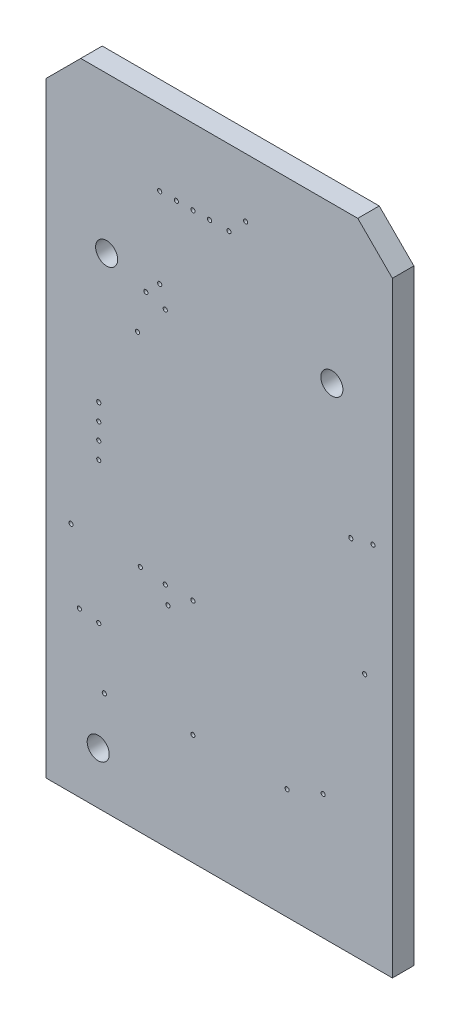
ISO-10303-21;
HEADER;
FILE_DESCRIPTION(('STEP AP214'),'2;1');
FILE_NAME('part.step','',(''),(''),'','','');
FILE_SCHEMA(('AUTOMOTIVE_DESIGN { 1 0 10303 214 1 1 1 1 }'));
ENDSEC;
DATA;
#1=APPLICATION_CONTEXT('core data for automotive mechanical design processes');
#2=APPLICATION_PROTOCOL_DEFINITION('international standard','automotive_design',2000,#1);
#3=PRODUCT_CONTEXT('',#1,'mechanical');
#4=PRODUCT('Part','Part','',(#3));
#5=PRODUCT_RELATED_PRODUCT_CATEGORY('part','',(#4));
#6=PRODUCT_DEFINITION_FORMATION('','',#4);
#7=PRODUCT_DEFINITION_CONTEXT('part definition',#1,'design');
#8=PRODUCT_DEFINITION('design','',#6,#7);
#9=PRODUCT_DEFINITION_SHAPE('','',#8);
#10=(LENGTH_UNIT() NAMED_UNIT(*) SI_UNIT(.MILLI.,.METRE.));
#11=(NAMED_UNIT(*) PLANE_ANGLE_UNIT() SI_UNIT($,.RADIAN.));
#12=(NAMED_UNIT(*) SI_UNIT($,.STERADIAN.) SOLID_ANGLE_UNIT());
#13=UNCERTAINTY_MEASURE_WITH_UNIT(LENGTH_MEASURE(1.E-05),#10,'distance_accuracy_value','');
#14=(GEOMETRIC_REPRESENTATION_CONTEXT(3) GLOBAL_UNCERTAINTY_ASSIGNED_CONTEXT((#13)) GLOBAL_UNIT_ASSIGNED_CONTEXT((#10,
#11,#12)) REPRESENTATION_CONTEXT('',''));
#15=CARTESIAN_POINT('',(0.,0.,0.));
#16=DIRECTION('',(0.,0.,1.));
#17=DIRECTION('',(1.,0.,0.));
#18=AXIS2_PLACEMENT_3D('',#15,#16,#17);
#19=CARTESIAN_POINT('',(12.7,0.,0.7874));
#20=DIRECTION('',(0.,1.,0.));
#21=DIRECTION('',(0.,0.,1.));
#22=AXIS2_PLACEMENT_3D('',#19,#20,#21);
#23=PLANE('',#22);
#24=DIRECTION('',(1.,0.,0.));
#25=VECTOR('',#24,1.);
#26=CARTESIAN_POINT('',(12.7,0.,0.));
#27=LINE('',#26,#25);
#28=CARTESIAN_POINT('',(0.,0.,0.));
#29=VERTEX_POINT('',#28);
#30=CARTESIAN_POINT('',(12.7,0.,0.));
#31=VERTEX_POINT('',#30);
#32=EDGE_CURVE('E125',#29,#31,#27,.T.);
#33=ORIENTED_EDGE('',*,*,#32,.T.);
#34=DIRECTION('',(0.,0.,-1.));
#35=VECTOR('',#34,1.);
#36=CARTESIAN_POINT('',(12.7,0.,0.7874));
#37=LINE('',#36,#35);
#38=CARTESIAN_POINT('',(12.7,0.,0.7874));
#39=VERTEX_POINT('',#38);
#40=EDGE_CURVE('E11',#39,#31,#37,.T.);
#41=ORIENTED_EDGE('',*,*,#40,.F.);
#42=DIRECTION('',(1.,0.,0.));
#43=VECTOR('',#42,1.);
#44=CARTESIAN_POINT('',(12.7,0.,0.7874));
#45=LINE('',#44,#43);
#46=CARTESIAN_POINT('',(0.,0.,0.7874));
#47=VERTEX_POINT('',#46);
#48=EDGE_CURVE('E136',#47,#39,#45,.T.);
#49=ORIENTED_EDGE('',*,*,#48,.F.);
#50=DIRECTION('',(0.,0.,-1.));
#51=VECTOR('',#50,1.);
#52=CARTESIAN_POINT('',(0.,0.,0.7874));
#53=LINE('',#52,#51);
#54=EDGE_CURVE('E121',#47,#29,#53,.T.);
#55=ORIENTED_EDGE('',*,*,#54,.T.);
#56=EDGE_LOOP('',(#33,#41,#49,#55));
#57=FACE_BOUND('',#56,.T.);
#58=ADVANCED_FACE('F41',(#57),#23,.F.);
#59=CARTESIAN_POINT('',(12.7,22.225,0.7874));
#60=DIRECTION('',(-1.,0.,0.));
#61=DIRECTION('',(0.,0.,1.));
#62=AXIS2_PLACEMENT_3D('',#59,#60,#61);
#63=PLANE('',#62);
#64=DIRECTION('',(0.,1.,0.));
#65=VECTOR('',#64,1.);
#66=CARTESIAN_POINT('',(12.7,22.225,0.));
#67=LINE('',#66,#65);
#68=CARTESIAN_POINT('',(12.7,22.225,0.));
#69=VERTEX_POINT('',#68);
#70=EDGE_CURVE('E128',#31,#69,#67,.T.);
#71=ORIENTED_EDGE('',*,*,#70,.T.);
#72=DIRECTION('',(0.,0.,-1.));
#73=VECTOR('',#72,1.);
#74=CARTESIAN_POINT('',(12.7,22.225,0.7874));
#75=LINE('',#74,#73);
#76=CARTESIAN_POINT('',(12.7,22.225,0.7874));
#77=VERTEX_POINT('',#76);
#78=EDGE_CURVE('E49',#77,#69,#75,.T.);
#79=ORIENTED_EDGE('',*,*,#78,.F.);
#80=DIRECTION('',(0.,1.,0.));
#81=VECTOR('',#80,1.);
#82=CARTESIAN_POINT('',(12.7,22.225,0.7874));
#83=LINE('',#82,#81);
#84=EDGE_CURVE('E94',#39,#77,#83,.T.);
#85=ORIENTED_EDGE('',*,*,#84,.F.);
#86=ORIENTED_EDGE('',*,*,#40,.T.);
#87=EDGE_LOOP('',(#71,#79,#85,#86));
#88=FACE_BOUND('',#87,.T.);
#89=ADVANCED_FACE('F161',(#88),#63,.F.);
#90=CARTESIAN_POINT('',(11.43,23.495,0.7874));
#91=DIRECTION('',(-0.707106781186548,-0.707106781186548,0.));
#92=DIRECTION('',(0.707106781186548,-0.707106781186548,0.));
#93=AXIS2_PLACEMENT_3D('',#90,#91,#92);
#94=PLANE('',#93);
#95=DIRECTION('',(-0.707106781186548,0.707106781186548,0.));
#96=VECTOR('',#95,1.);
#97=CARTESIAN_POINT('',(11.43,23.495,0.));
#98=LINE('',#97,#96);
#99=CARTESIAN_POINT('',(11.43,23.495,0.));
#100=VERTEX_POINT('',#99);
#101=EDGE_CURVE('E131',#69,#100,#98,.T.);
#102=ORIENTED_EDGE('',*,*,#101,.T.);
#103=DIRECTION('',(0.,0.,-1.));
#104=VECTOR('',#103,1.);
#105=CARTESIAN_POINT('',(11.43,23.495,0.7874));
#106=LINE('',#105,#104);
#107=CARTESIAN_POINT('',(11.43,23.495,0.7874));
#108=VERTEX_POINT('',#107);
#109=EDGE_CURVE('E116',#108,#100,#106,.T.);
#110=ORIENTED_EDGE('',*,*,#109,.F.);
#111=DIRECTION('',(-0.707106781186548,0.707106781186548,0.));
#112=VECTOR('',#111,1.);
#113=CARTESIAN_POINT('',(11.43,23.495,0.7874));
#114=LINE('',#113,#112);
#115=EDGE_CURVE('E107',#77,#108,#114,.T.);
#116=ORIENTED_EDGE('',*,*,#115,.F.);
#117=ORIENTED_EDGE('',*,*,#78,.T.);
#118=EDGE_LOOP('',(#102,#110,#116,#117));
#119=FACE_BOUND('',#118,.T.);
#120=ADVANCED_FACE('F142',(#119),#94,.F.);
#121=CARTESIAN_POINT('',(1.27,23.495,0.7874));
#122=DIRECTION('',(0.,-1.,0.));
#123=DIRECTION('',(0.,0.,-1.));
#124=AXIS2_PLACEMENT_3D('',#121,#122,#123);
#125=PLANE('',#124);
#126=DIRECTION('',(-1.,0.,0.));
#127=VECTOR('',#126,1.);
#128=CARTESIAN_POINT('',(1.27,23.495,0.));
#129=LINE('',#128,#127);
#130=CARTESIAN_POINT('',(1.27,23.495,0.));
#131=VERTEX_POINT('',#130);
#132=EDGE_CURVE('E115',#100,#131,#129,.T.);
#133=ORIENTED_EDGE('',*,*,#132,.T.);
#134=DIRECTION('',(0.,0.,-1.));
#135=VECTOR('',#134,1.);
#136=CARTESIAN_POINT('',(1.27,23.495,0.7874));
#137=LINE('',#136,#135);
#138=CARTESIAN_POINT('',(1.27,23.495,0.7874));
#139=VERTEX_POINT('',#138);
#140=EDGE_CURVE('E112',#139,#131,#137,.T.);
#141=ORIENTED_EDGE('',*,*,#140,.F.);
#142=DIRECTION('',(-1.,0.,0.));
#143=VECTOR('',#142,1.);
#144=CARTESIAN_POINT('',(1.27,23.495,0.7874));
#145=LINE('',#144,#143);
#146=EDGE_CURVE('E101',#108,#139,#145,.T.);
#147=ORIENTED_EDGE('',*,*,#146,.F.);
#148=ORIENTED_EDGE('',*,*,#109,.T.);
#149=EDGE_LOOP('',(#133,#141,#147,#148));
#150=FACE_BOUND('',#149,.T.);
#151=ADVANCED_FACE('F113',(#150),#125,.F.);
#152=CARTESIAN_POINT('',(0.,22.225,0.7874));
#153=DIRECTION('',(0.707106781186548,-0.707106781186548,0.));
#154=DIRECTION('',(0.707106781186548,0.707106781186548,0.));
#155=AXIS2_PLACEMENT_3D('',#152,#153,#154);
#156=PLANE('',#155);
#157=DIRECTION('',(-0.707106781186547,-0.707106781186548,0.));
#158=VECTOR('',#157,1.);
#159=CARTESIAN_POINT('',(0.,22.225,0.));
#160=LINE('',#159,#158);
#161=CARTESIAN_POINT('',(0.,22.225,0.));
#162=VERTEX_POINT('',#161);
#163=EDGE_CURVE('E80',#131,#162,#160,.T.);
#164=ORIENTED_EDGE('',*,*,#163,.T.);
#165=DIRECTION('',(0.,0.,-1.));
#166=VECTOR('',#165,1.);
#167=CARTESIAN_POINT('',(0.,22.225,0.7874));
#168=LINE('',#167,#166);
#169=CARTESIAN_POINT('',(0.,22.225,0.7874));
#170=VERTEX_POINT('',#169);
#171=EDGE_CURVE('E117',#170,#162,#168,.T.);
#172=ORIENTED_EDGE('',*,*,#171,.F.);
#173=DIRECTION('',(-0.707106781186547,-0.707106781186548,0.));
#174=VECTOR('',#173,1.);
#175=CARTESIAN_POINT('',(0.,22.225,0.7874));
#176=LINE('',#175,#174);
#177=EDGE_CURVE('E105',#139,#170,#176,.T.);
#178=ORIENTED_EDGE('',*,*,#177,.F.);
#179=ORIENTED_EDGE('',*,*,#140,.T.);
#180=EDGE_LOOP('',(#164,#172,#178,#179));
#181=FACE_BOUND('',#180,.T.);
#182=ADVANCED_FACE('F119',(#181),#156,.F.);
#183=CARTESIAN_POINT('',(0.,0.,0.7874));
#184=DIRECTION('',(1.,0.,0.));
#185=DIRECTION('',(0.,0.,-1.));
#186=AXIS2_PLACEMENT_3D('',#183,#184,#185);
#187=PLANE('',#186);
#188=DIRECTION('',(0.,-1.,0.));
#189=VECTOR('',#188,1.);
#190=CARTESIAN_POINT('',(0.,0.,0.));
#191=LINE('',#190,#189);
#192=EDGE_CURVE('E86',#162,#29,#191,.T.);
#193=ORIENTED_EDGE('',*,*,#192,.T.);
#194=ORIENTED_EDGE('',*,*,#54,.F.);
#195=DIRECTION('',(0.,-1.,0.));
#196=VECTOR('',#195,1.);
#197=CARTESIAN_POINT('',(0.,0.,0.7874));
#198=LINE('',#197,#196);
#199=EDGE_CURVE('E57',#170,#47,#198,.T.);
#200=ORIENTED_EDGE('',*,*,#199,.F.);
#201=ORIENTED_EDGE('',*,*,#171,.T.);
#202=EDGE_LOOP('',(#193,#194,#200,#201));
#203=FACE_BOUND('',#202,.T.);
#204=ADVANCED_FACE('F149',(#203),#187,.F.);
#205=CARTESIAN_POINT('',(0.,0.,0.7874));
#206=DIRECTION('',(0.,0.,-1.));
#207=DIRECTION('',(-1.,0.,0.));
#208=AXIS2_PLACEMENT_3D('',#205,#206,#207);
#209=PLANE('',#208);
#210=CARTESIAN_POINT('',(1.91,1.91,0.7874));
#211=DIRECTION('',(0.,0.,1.));
#212=DIRECTION('',(1.,0.,0.));
#213=AXIS2_PLACEMENT_3D('',#210,#211,#212);
#214=CIRCLE('',#213,0.405);
#215=CARTESIAN_POINT('',(2.315,1.91,0.7874));
#216=VERTEX_POINT('',#215);
#217=EDGE_CURVE('E537',#216,#216,#214,.T.);
#218=ORIENTED_EDGE('',*,*,#217,.F.);
#219=EDGE_LOOP('',(#218));
#220=FACE_BOUND('',#219,.T.);
#221=CARTESIAN_POINT('',(10.48,17.78,0.7874));
#222=DIRECTION('',(0.,0.,1.));
#223=DIRECTION('',(1.,0.,0.));
#224=AXIS2_PLACEMENT_3D('',#221,#222,#223);
#225=CIRCLE('',#224,0.405000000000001);
#226=CARTESIAN_POINT('',(10.885,17.78,0.7874));
#227=VERTEX_POINT('',#226);
#228=EDGE_CURVE('E553',#227,#227,#225,.T.);
#229=ORIENTED_EDGE('',*,*,#228,.F.);
#230=EDGE_LOOP('',(#229));
#231=FACE_BOUND('',#230,.T.);
#232=CARTESIAN_POINT('',(2.22,17.78,0.7874));
#233=DIRECTION('',(0.,0.,1.));
#234=DIRECTION('',(1.,0.,0.));
#235=AXIS2_PLACEMENT_3D('',#232,#233,#234);
#236=CIRCLE('',#235,0.405);
#237=CARTESIAN_POINT('',(2.625,17.78,0.7874));
#238=VERTEX_POINT('',#237);
#239=EDGE_CURVE('E546',#238,#238,#236,.T.);
#240=ORIENTED_EDGE('',*,*,#239,.F.);
#241=EDGE_LOOP('',(#240));
#242=FACE_BOUND('',#241,.T.);
#243=CARTESIAN_POINT('',(2.1336,3.7592,0.7874));
#244=DIRECTION('',(0.,0.,1.));
#245=DIRECTION('',(1.,0.,0.));
#246=AXIS2_PLACEMENT_3D('',#243,#244,#245);
#247=CIRCLE('',#246,0.0761999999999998);
#248=CARTESIAN_POINT('',(2.2098,3.7592,0.7874));
#249=VERTEX_POINT('',#248);
#250=EDGE_CURVE('E644',#249,#249,#247,.T.);
#251=ORIENTED_EDGE('',*,*,#250,.F.);
#252=EDGE_LOOP('',(#251));
#253=FACE_BOUND('',#252,.T.);
#254=CARTESIAN_POINT('',(4.4704,7.7216,0.7874));
#255=DIRECTION('',(0.,0.,1.));
#256=DIRECTION('',(1.,0.,0.));
#257=AXIS2_PLACEMENT_3D('',#254,#255,#256);
#258=CIRCLE('',#257,0.0762000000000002);
#259=CARTESIAN_POINT('',(4.5466,7.7216,0.7874));
#260=VERTEX_POINT('',#259);
#261=EDGE_CURVE('E651',#260,#260,#258,.T.);
#262=ORIENTED_EDGE('',*,*,#261,.F.);
#263=EDGE_LOOP('',(#262));
#264=FACE_BOUND('',#263,.T.);
#265=CARTESIAN_POINT('',(8.8392,4.064,0.7874));
#266=DIRECTION('',(0.,0.,1.));
#267=DIRECTION('',(1.,0.,0.));
#268=AXIS2_PLACEMENT_3D('',#265,#266,#267);
#269=CIRCLE('',#268,0.0762000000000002);
#270=CARTESIAN_POINT('',(8.9154,4.064,0.7874));
#271=VERTEX_POINT('',#270);
#272=EDGE_CURVE('E657',#271,#271,#269,.T.);
#273=ORIENTED_EDGE('',*,*,#272,.F.);
#274=EDGE_LOOP('',(#273));
#275=FACE_BOUND('',#274,.T.);
#276=CARTESIAN_POINT('',(5.3848,20.7264,0.7874));
#277=DIRECTION('',(0.,0.,1.));
#278=DIRECTION('',(1.,0.,0.));
#279=AXIS2_PLACEMENT_3D('',#276,#277,#278);
#280=CIRCLE('',#279,0.0762000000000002);
#281=CARTESIAN_POINT('',(5.461,20.7264,0.7874));
#282=VERTEX_POINT('',#281);
#283=EDGE_CURVE('E663',#282,#282,#280,.T.);
#284=ORIENTED_EDGE('',*,*,#283,.F.);
#285=EDGE_LOOP('',(#284));
#286=FACE_BOUND('',#285,.T.);
#287=CARTESIAN_POINT('',(4.1656,20.7264,0.7874));
#288=DIRECTION('',(0.,0.,1.));
#289=DIRECTION('',(1.,0.,0.));
#290=AXIS2_PLACEMENT_3D('',#287,#288,#289);
#291=CIRCLE('',#290,0.0762000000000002);
#292=CARTESIAN_POINT('',(4.2418,20.7264,0.7874));
#293=VERTEX_POINT('',#292);
#294=EDGE_CURVE('E627',#293,#293,#291,.T.);
#295=ORIENTED_EDGE('',*,*,#294,.F.);
#296=EDGE_LOOP('',(#295));
#297=FACE_BOUND('',#296,.T.);
#298=CARTESIAN_POINT('',(4.3688,17.0688,0.7874));
#299=DIRECTION('',(0.,0.,1.));
#300=DIRECTION('',(1.,0.,0.));
#301=AXIS2_PLACEMENT_3D('',#298,#299,#300);
#302=CIRCLE('',#301,0.0762000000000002);
#303=CARTESIAN_POINT('',(4.445,17.0688,0.7874));
#304=VERTEX_POINT('',#303);
#305=EDGE_CURVE('E620',#304,#304,#302,.T.);
#306=ORIENTED_EDGE('',*,*,#305,.F.);
#307=EDGE_LOOP('',(#306));
#308=FACE_BOUND('',#307,.T.);
#309=CARTESIAN_POINT('',(4.7752,20.7264,0.7874));
#310=DIRECTION('',(0.,0.,1.));
#311=DIRECTION('',(1.,0.,0.));
#312=AXIS2_PLACEMENT_3D('',#309,#310,#311);
#313=CIRCLE('',#312,0.0762000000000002);
#314=CARTESIAN_POINT('',(4.8514,20.7264,0.7874));
#315=VERTEX_POINT('',#314);
#316=EDGE_CURVE('E639',#315,#315,#313,.T.);
#317=ORIENTED_EDGE('',*,*,#316,.F.);
#318=EDGE_LOOP('',(#317));
#319=FACE_BOUND('',#318,.T.);
#320=CARTESIAN_POINT('',(3.3528,15.8496,0.7874));
#321=DIRECTION('',(0.,0.,1.));
#322=DIRECTION('',(1.,0.,0.));
#323=AXIS2_PLACEMENT_3D('',#320,#321,#322);
#324=CIRCLE('',#323,0.0761999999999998);
#325=CARTESIAN_POINT('',(3.429,15.8496,0.7874));
#326=VERTEX_POINT('',#325);
#327=EDGE_CURVE('E632',#326,#326,#324,.T.);
#328=ORIENTED_EDGE('',*,*,#327,.F.);
#329=EDGE_LOOP('',(#328));
#330=FACE_BOUND('',#329,.T.);
#331=CARTESIAN_POINT('',(10.16,4.572,0.7874));
#332=DIRECTION('',(0.,0.,1.));
#333=DIRECTION('',(1.,0.,0.));
#334=AXIS2_PLACEMENT_3D('',#331,#332,#333);
#335=CIRCLE('',#334,0.0762000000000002);
#336=CARTESIAN_POINT('',(10.2362,4.572,0.7874));
#337=VERTEX_POINT('',#336);
#338=EDGE_CURVE('E692',#337,#337,#335,.T.);
#339=ORIENTED_EDGE('',*,*,#338,.F.);
#340=EDGE_LOOP('',(#339));
#341=FACE_BOUND('',#340,.T.);
#342=CARTESIAN_POINT('',(11.684,9.144,0.7874));
#343=DIRECTION('',(0.,0.,1.));
#344=DIRECTION('',(1.,0.,0.));
#345=AXIS2_PLACEMENT_3D('',#342,#343,#344);
#346=CIRCLE('',#345,0.0762000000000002);
#347=CARTESIAN_POINT('',(11.7602,9.144,0.7874));
#348=VERTEX_POINT('',#347);
#349=EDGE_CURVE('E699',#348,#348,#346,.T.);
#350=ORIENTED_EDGE('',*,*,#349,.F.);
#351=EDGE_LOOP('',(#350));
#352=FACE_BOUND('',#351,.T.);
#353=CARTESIAN_POINT('',(4.3688,8.3312,0.7874));
#354=DIRECTION('',(0.,0.,1.));
#355=DIRECTION('',(1.,0.,0.));
#356=AXIS2_PLACEMENT_3D('',#353,#354,#355);
#357=CIRCLE('',#356,0.0762000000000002);
#358=CARTESIAN_POINT('',(4.445,8.3312,0.7874));
#359=VERTEX_POINT('',#358);
#360=EDGE_CURVE('E705',#359,#359,#357,.T.);
#361=ORIENTED_EDGE('',*,*,#360,.F.);
#362=EDGE_LOOP('',(#361));
#363=FACE_BOUND('',#362,.T.);
#364=CARTESIAN_POINT('',(1.9304,11.684,0.7874));
#365=DIRECTION('',(0.,0.,1.));
#366=DIRECTION('',(1.,0.,0.));
#367=AXIS2_PLACEMENT_3D('',#364,#365,#366);
#368=CIRCLE('',#367,0.0762);
#369=CARTESIAN_POINT('',(2.0066,11.684,0.7874));
#370=VERTEX_POINT('',#369);
#371=EDGE_CURVE('E711',#370,#370,#368,.T.);
#372=ORIENTED_EDGE('',*,*,#371,.F.);
#373=EDGE_LOOP('',(#372));
#374=FACE_BOUND('',#373,.T.);
#375=CARTESIAN_POINT('',(7.3152,21.336,0.7874));
#376=DIRECTION('',(0.,0.,1.));
#377=DIRECTION('',(1.,0.,0.));
#378=AXIS2_PLACEMENT_3D('',#375,#376,#377);
#379=CIRCLE('',#378,0.0762000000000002);
#380=CARTESIAN_POINT('',(7.3914,21.336,0.7874));
#381=VERTEX_POINT('',#380);
#382=EDGE_CURVE('E668',#381,#381,#379,.T.);
#383=ORIENTED_EDGE('',*,*,#382,.F.);
#384=EDGE_LOOP('',(#383));
#385=FACE_BOUND('',#384,.T.);
#386=CARTESIAN_POINT('',(6.7056,20.7264,0.7874));
#387=DIRECTION('',(0.,0.,1.));
#388=DIRECTION('',(1.,0.,0.));
#389=AXIS2_PLACEMENT_3D('',#386,#387,#388);
#390=CIRCLE('',#389,0.0762000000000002);
#391=CARTESIAN_POINT('',(6.7818,20.7264,0.7874));
#392=VERTEX_POINT('',#391);
#393=EDGE_CURVE('E675',#392,#392,#390,.T.);
#394=ORIENTED_EDGE('',*,*,#393,.F.);
#395=EDGE_LOOP('',(#394));
#396=FACE_BOUND('',#395,.T.);
#397=CARTESIAN_POINT('',(11.176,13.208,0.7874));
#398=DIRECTION('',(0.,0.,1.));
#399=DIRECTION('',(1.,0.,0.));
#400=AXIS2_PLACEMENT_3D('',#397,#398,#399);
#401=CIRCLE('',#400,0.0762000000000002);
#402=CARTESIAN_POINT('',(11.2522,13.208,0.7874));
#403=VERTEX_POINT('',#402);
#404=EDGE_CURVE('E681',#403,#403,#401,.T.);
#405=ORIENTED_EDGE('',*,*,#404,.F.);
#406=EDGE_LOOP('',(#405));
#407=FACE_BOUND('',#406,.T.);
#408=CARTESIAN_POINT('',(3.4544,8.4328,0.7874));
#409=DIRECTION('',(0.,0.,1.));
#410=DIRECTION('',(1.,0.,0.));
#411=AXIS2_PLACEMENT_3D('',#408,#409,#410);
#412=CIRCLE('',#411,0.0761999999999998);
#413=CARTESIAN_POINT('',(3.5306,8.4328,0.7874));
#414=VERTEX_POINT('',#413);
#415=EDGE_CURVE('E687',#414,#414,#412,.T.);
#416=ORIENTED_EDGE('',*,*,#415,.F.);
#417=EDGE_LOOP('',(#416));
#418=FACE_BOUND('',#417,.T.);
#419=CARTESIAN_POINT('',(11.9888,13.4112,0.7874));
#420=DIRECTION('',(0.,0.,1.));
#421=DIRECTION('',(1.,0.,0.));
#422=AXIS2_PLACEMENT_3D('',#419,#420,#421);
#423=CIRCLE('',#422,0.0762000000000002);
#424=CARTESIAN_POINT('',(12.065,13.4112,0.7874));
#425=VERTEX_POINT('',#424);
#426=EDGE_CURVE('E567',#425,#425,#423,.T.);
#427=ORIENTED_EDGE('',*,*,#426,.F.);
#428=EDGE_LOOP('',(#427));
#429=FACE_BOUND('',#428,.T.);
#430=CARTESIAN_POINT('',(1.9304,11.0744,0.7874));
#431=DIRECTION('',(0.,0.,1.));
#432=DIRECTION('',(1.,0.,0.));
#433=AXIS2_PLACEMENT_3D('',#430,#431,#432);
#434=CIRCLE('',#433,0.0762);
#435=CARTESIAN_POINT('',(2.0066,11.0744,0.7874));
#436=VERTEX_POINT('',#435);
#437=EDGE_CURVE('E561',#436,#436,#434,.T.);
#438=ORIENTED_EDGE('',*,*,#437,.F.);
#439=EDGE_LOOP('',(#438));
#440=FACE_BOUND('',#439,.T.);
#441=CARTESIAN_POINT('',(1.9304,12.9032,0.7874));
#442=DIRECTION('',(0.,0.,1.));
#443=DIRECTION('',(1.,0.,0.));
#444=AXIS2_PLACEMENT_3D('',#441,#442,#443);
#445=CIRCLE('',#444,0.0762);
#446=CARTESIAN_POINT('',(2.0066,12.9032,0.7874));
#447=VERTEX_POINT('',#446);
#448=EDGE_CURVE('E554',#447,#447,#445,.T.);
#449=ORIENTED_EDGE('',*,*,#448,.F.);
#450=EDGE_LOOP('',(#449));
#451=FACE_BOUND('',#450,.T.);
#452=CARTESIAN_POINT('',(4.1656,17.78,0.7874));
#453=DIRECTION('',(0.,0.,1.));
#454=DIRECTION('',(1.,0.,0.));
#455=AXIS2_PLACEMENT_3D('',#452,#453,#454);
#456=CIRCLE('',#455,0.0762000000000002);
#457=CARTESIAN_POINT('',(4.2418,17.78,0.7874));
#458=VERTEX_POINT('',#457);
#459=EDGE_CURVE('E596',#458,#458,#456,.T.);
#460=ORIENTED_EDGE('',*,*,#459,.F.);
#461=EDGE_LOOP('',(#460));
#462=FACE_BOUND('',#461,.T.);
#463=CARTESIAN_POINT('',(5.9944,20.7264,0.7874));
#464=DIRECTION('',(0.,0.,1.));
#465=DIRECTION('',(1.,0.,0.));
#466=AXIS2_PLACEMENT_3D('',#463,#464,#465);
#467=CIRCLE('',#466,0.0762000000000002);
#468=CARTESIAN_POINT('',(6.0706,20.7264,0.7874));
#469=VERTEX_POINT('',#468);
#470=EDGE_CURVE('E603',#469,#469,#467,.T.);
#471=ORIENTED_EDGE('',*,*,#470,.F.);
#472=EDGE_LOOP('',(#471));
#473=FACE_BOUND('',#472,.T.);
#474=CARTESIAN_POINT('',(3.6576,17.272,0.7874));
#475=DIRECTION('',(0.,0.,1.));
#476=DIRECTION('',(1.,0.,0.));
#477=AXIS2_PLACEMENT_3D('',#474,#475,#476);
#478=CIRCLE('',#477,0.0761999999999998);
#479=CARTESIAN_POINT('',(3.7338,17.272,0.7874));
#480=VERTEX_POINT('',#479);
#481=EDGE_CURVE('E609',#480,#480,#478,.T.);
#482=ORIENTED_EDGE('',*,*,#481,.F.);
#483=EDGE_LOOP('',(#482));
#484=FACE_BOUND('',#483,.T.);
#485=CARTESIAN_POINT('',(5.3848,8.3312,0.7874));
#486=DIRECTION('',(0.,0.,1.));
#487=DIRECTION('',(1.,0.,0.));
#488=AXIS2_PLACEMENT_3D('',#485,#486,#487);
#489=CIRCLE('',#488,0.0762000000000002);
#490=CARTESIAN_POINT('',(5.461,8.3312,0.7874));
#491=VERTEX_POINT('',#490);
#492=EDGE_CURVE('E615',#491,#491,#489,.T.);
#493=ORIENTED_EDGE('',*,*,#492,.F.);
#494=EDGE_LOOP('',(#493));
#495=FACE_BOUND('',#494,.T.);
#496=CARTESIAN_POINT('',(0.9144,8.5344,0.7874));
#497=DIRECTION('',(0.,0.,1.));
#498=DIRECTION('',(1.,0.,0.));
#499=AXIS2_PLACEMENT_3D('',#496,#497,#498);
#500=CIRCLE('',#499,0.0761999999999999);
#501=CARTESIAN_POINT('',(0.9906,8.5344,0.7874));
#502=VERTEX_POINT('',#501);
#503=EDGE_CURVE('E579',#502,#502,#500,.T.);
#504=ORIENTED_EDGE('',*,*,#503,.F.);
#505=EDGE_LOOP('',(#504));
#506=FACE_BOUND('',#505,.T.);
#507=CARTESIAN_POINT('',(1.9304,5.8928,0.7874));
#508=DIRECTION('',(0.,0.,1.));
#509=DIRECTION('',(1.,0.,0.));
#510=AXIS2_PLACEMENT_3D('',#507,#508,#509);
#511=CIRCLE('',#510,0.0762);
#512=CARTESIAN_POINT('',(2.0066,5.8928,0.7874));
#513=VERTEX_POINT('',#512);
#514=EDGE_CURVE('E572',#513,#513,#511,.T.);
#515=ORIENTED_EDGE('',*,*,#514,.F.);
#516=EDGE_LOOP('',(#515));
#517=FACE_BOUND('',#516,.T.);
#518=CARTESIAN_POINT('',(1.9304,12.2936,0.7874));
#519=DIRECTION('',(0.,0.,1.));
#520=DIRECTION('',(1.,0.,0.));
#521=AXIS2_PLACEMENT_3D('',#518,#519,#520);
#522=CIRCLE('',#521,0.0762);
#523=CARTESIAN_POINT('',(2.0066,12.2936,0.7874));
#524=VERTEX_POINT('',#523);
#525=EDGE_CURVE('E591',#524,#524,#522,.T.);
#526=ORIENTED_EDGE('',*,*,#525,.F.);
#527=EDGE_LOOP('',(#526));
#528=FACE_BOUND('',#527,.T.);
#529=CARTESIAN_POINT('',(5.3848,4.064,0.7874));
#530=DIRECTION('',(0.,0.,1.));
#531=DIRECTION('',(1.,0.,0.));
#532=AXIS2_PLACEMENT_3D('',#529,#530,#531);
#533=CIRCLE('',#532,0.0762000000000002);
#534=CARTESIAN_POINT('',(5.461,4.064,0.7874));
#535=VERTEX_POINT('',#534);
#536=EDGE_CURVE('E584',#535,#535,#533,.T.);
#537=ORIENTED_EDGE('',*,*,#536,.F.);
#538=EDGE_LOOP('',(#537));
#539=FACE_BOUND('',#538,.T.);
#540=CARTESIAN_POINT('',(1.2192,5.9944,0.7874));
#541=DIRECTION('',(0.,0.,1.));
#542=DIRECTION('',(1.,0.,0.));
#543=AXIS2_PLACEMENT_3D('',#540,#541,#542);
#544=CIRCLE('',#543,0.0762);
#545=CARTESIAN_POINT('',(1.2954,5.9944,0.7874));
#546=VERTEX_POINT('',#545);
#547=EDGE_CURVE('E129',#546,#546,#544,.T.);
#548=ORIENTED_EDGE('',*,*,#547,.F.);
#549=EDGE_LOOP('',(#548));
#550=FACE_BOUND('',#549,.T.);
#551=ORIENTED_EDGE('',*,*,#48,.T.);
#552=ORIENTED_EDGE('',*,*,#84,.T.);
#553=ORIENTED_EDGE('',*,*,#115,.T.);
#554=ORIENTED_EDGE('',*,*,#146,.T.);
#555=ORIENTED_EDGE('',*,*,#177,.T.);
#556=ORIENTED_EDGE('',*,*,#199,.T.);
#557=EDGE_LOOP('',(#551,#552,#553,#554,#555,#556));
#558=FACE_BOUND('',#557,.T.);
#559=ADVANCED_FACE('F103',(#220,#231,#242,#253,#264,#275,#286,#297,#308,#319,#330,#341,#352,
#363,#374,#385,#396,#407,#418,#429,#440,#451,#462,#473,#484,#495,#506,#517,#528,#539,#550,#558),
#209,.F.);
#560=CARTESIAN_POINT('',(0.,0.,0.));
#561=DIRECTION('',(0.,0.,-1.));
#562=DIRECTION('',(-1.,0.,0.));
#563=AXIS2_PLACEMENT_3D('',#560,#561,#562);
#564=PLANE('',#563);
#565=CARTESIAN_POINT('',(1.91,1.91,0.));
#566=DIRECTION('',(0.,0.,1.));
#567=DIRECTION('',(1.,0.,0.));
#568=AXIS2_PLACEMENT_3D('',#565,#566,#567);
#569=CIRCLE('',#568,0.405);
#570=CARTESIAN_POINT('',(2.315,1.91,0.));
#571=VERTEX_POINT('',#570);
#572=EDGE_CURVE('E540',#571,#571,#569,.T.);
#573=ORIENTED_EDGE('',*,*,#572,.T.);
#574=EDGE_LOOP('',(#573));
#575=FACE_BOUND('',#574,.T.);
#576=CARTESIAN_POINT('',(10.48,17.78,0.));
#577=DIRECTION('',(0.,0.,1.));
#578=DIRECTION('',(1.,0.,0.));
#579=AXIS2_PLACEMENT_3D('',#576,#577,#578);
#580=CIRCLE('',#579,0.405000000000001);
#581=CARTESIAN_POINT('',(10.885,17.78,0.));
#582=VERTEX_POINT('',#581);
#583=EDGE_CURVE('E542',#582,#582,#580,.T.);
#584=ORIENTED_EDGE('',*,*,#583,.T.);
#585=EDGE_LOOP('',(#584));
#586=FACE_BOUND('',#585,.T.);
#587=CARTESIAN_POINT('',(2.22,17.78,0.));
#588=DIRECTION('',(0.,0.,1.));
#589=DIRECTION('',(1.,0.,0.));
#590=AXIS2_PLACEMENT_3D('',#587,#588,#589);
#591=CIRCLE('',#590,0.405);
#592=CARTESIAN_POINT('',(2.625,17.78,0.));
#593=VERTEX_POINT('',#592);
#594=EDGE_CURVE('E550',#593,#593,#591,.T.);
#595=ORIENTED_EDGE('',*,*,#594,.T.);
#596=EDGE_LOOP('',(#595));
#597=FACE_BOUND('',#596,.T.);
#598=CARTESIAN_POINT('',(2.1336,3.7592,0.));
#599=DIRECTION('',(0.,0.,1.));
#600=DIRECTION('',(1.,0.,0.));
#601=AXIS2_PLACEMENT_3D('',#598,#599,#600);
#602=CIRCLE('',#601,0.0761999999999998);
#603=CARTESIAN_POINT('',(2.2098,3.7592,0.));
#604=VERTEX_POINT('',#603);
#605=EDGE_CURVE('E648',#604,#604,#602,.T.);
#606=ORIENTED_EDGE('',*,*,#605,.T.);
#607=EDGE_LOOP('',(#606));
#608=FACE_BOUND('',#607,.T.);
#609=CARTESIAN_POINT('',(4.4704,7.7216,0.));
#610=DIRECTION('',(0.,0.,1.));
#611=DIRECTION('',(1.,0.,0.));
#612=AXIS2_PLACEMENT_3D('',#609,#610,#611);
#613=CIRCLE('',#612,0.0762000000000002);
#614=CARTESIAN_POINT('',(4.5466,7.7216,0.));
#615=VERTEX_POINT('',#614);
#616=EDGE_CURVE('E654',#615,#615,#613,.T.);
#617=ORIENTED_EDGE('',*,*,#616,.T.);
#618=EDGE_LOOP('',(#617));
#619=FACE_BOUND('',#618,.T.);
#620=CARTESIAN_POINT('',(8.8392,4.064,0.));
#621=DIRECTION('',(0.,0.,1.));
#622=DIRECTION('',(1.,0.,0.));
#623=AXIS2_PLACEMENT_3D('',#620,#621,#622);
#624=CIRCLE('',#623,0.0762000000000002);
#625=CARTESIAN_POINT('',(8.9154,4.064,0.));
#626=VERTEX_POINT('',#625);
#627=EDGE_CURVE('E660',#626,#626,#624,.T.);
#628=ORIENTED_EDGE('',*,*,#627,.T.);
#629=EDGE_LOOP('',(#628));
#630=FACE_BOUND('',#629,.T.);
#631=CARTESIAN_POINT('',(5.3848,20.7264,0.));
#632=DIRECTION('',(0.,0.,1.));
#633=DIRECTION('',(1.,0.,0.));
#634=AXIS2_PLACEMENT_3D('',#631,#632,#633);
#635=CIRCLE('',#634,0.0762000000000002);
#636=CARTESIAN_POINT('',(5.461,20.7264,0.));
#637=VERTEX_POINT('',#636);
#638=EDGE_CURVE('E635',#637,#637,#635,.T.);
#639=ORIENTED_EDGE('',*,*,#638,.T.);
#640=EDGE_LOOP('',(#639));
#641=FACE_BOUND('',#640,.T.);
#642=CARTESIAN_POINT('',(4.1656,20.7264,0.));
#643=DIRECTION('',(0.,0.,1.));
#644=DIRECTION('',(1.,0.,0.));
#645=AXIS2_PLACEMENT_3D('',#642,#643,#644);
#646=CIRCLE('',#645,0.0762000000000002);
#647=CARTESIAN_POINT('',(4.2418,20.7264,0.));
#648=VERTEX_POINT('',#647);
#649=EDGE_CURVE('E599',#648,#648,#646,.T.);
#650=ORIENTED_EDGE('',*,*,#649,.T.);
#651=EDGE_LOOP('',(#650));
#652=FACE_BOUND('',#651,.T.);
#653=CARTESIAN_POINT('',(4.3688,17.0688,0.));
#654=DIRECTION('',(0.,0.,1.));
#655=DIRECTION('',(1.,0.,0.));
#656=AXIS2_PLACEMENT_3D('',#653,#654,#655);
#657=CIRCLE('',#656,0.0762000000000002);
#658=CARTESIAN_POINT('',(4.445,17.0688,0.));
#659=VERTEX_POINT('',#658);
#660=EDGE_CURVE('E624',#659,#659,#657,.T.);
#661=ORIENTED_EDGE('',*,*,#660,.T.);
#662=EDGE_LOOP('',(#661));
#663=FACE_BOUND('',#662,.T.);
#664=CARTESIAN_POINT('',(4.7752,20.7264,0.));
#665=DIRECTION('',(0.,0.,1.));
#666=DIRECTION('',(1.,0.,0.));
#667=AXIS2_PLACEMENT_3D('',#664,#665,#666);
#668=CIRCLE('',#667,0.0762000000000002);
#669=CARTESIAN_POINT('',(4.8514,20.7264,0.));
#670=VERTEX_POINT('',#669);
#671=EDGE_CURVE('E623',#670,#670,#668,.T.);
#672=ORIENTED_EDGE('',*,*,#671,.T.);
#673=EDGE_LOOP('',(#672));
#674=FACE_BOUND('',#673,.T.);
#675=CARTESIAN_POINT('',(3.3528,15.8496,0.));
#676=DIRECTION('',(0.,0.,1.));
#677=DIRECTION('',(1.,0.,0.));
#678=AXIS2_PLACEMENT_3D('',#675,#676,#677);
#679=CIRCLE('',#678,0.0761999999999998);
#680=CARTESIAN_POINT('',(3.429,15.8496,0.));
#681=VERTEX_POINT('',#680);
#682=EDGE_CURVE('E636',#681,#681,#679,.T.);
#683=ORIENTED_EDGE('',*,*,#682,.T.);
#684=EDGE_LOOP('',(#683));
#685=FACE_BOUND('',#684,.T.);
#686=CARTESIAN_POINT('',(10.16,4.572,0.));
#687=DIRECTION('',(0.,0.,1.));
#688=DIRECTION('',(1.,0.,0.));
#689=AXIS2_PLACEMENT_3D('',#686,#687,#688);
#690=CIRCLE('',#689,0.0762000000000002);
#691=CARTESIAN_POINT('',(10.2362,4.572,0.));
#692=VERTEX_POINT('',#691);
#693=EDGE_CURVE('E696',#692,#692,#690,.T.);
#694=ORIENTED_EDGE('',*,*,#693,.T.);
#695=EDGE_LOOP('',(#694));
#696=FACE_BOUND('',#695,.T.);
#697=CARTESIAN_POINT('',(11.684,9.144,0.));
#698=DIRECTION('',(0.,0.,1.));
#699=DIRECTION('',(1.,0.,0.));
#700=AXIS2_PLACEMENT_3D('',#697,#698,#699);
#701=CIRCLE('',#700,0.0762000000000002);
#702=CARTESIAN_POINT('',(11.7602,9.144,0.));
#703=VERTEX_POINT('',#702);
#704=EDGE_CURVE('E702',#703,#703,#701,.T.);
#705=ORIENTED_EDGE('',*,*,#704,.T.);
#706=EDGE_LOOP('',(#705));
#707=FACE_BOUND('',#706,.T.);
#708=CARTESIAN_POINT('',(4.3688,8.3312,0.));
#709=DIRECTION('',(0.,0.,1.));
#710=DIRECTION('',(1.,0.,0.));
#711=AXIS2_PLACEMENT_3D('',#708,#709,#710);
#712=CIRCLE('',#711,0.0762000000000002);
#713=CARTESIAN_POINT('',(4.445,8.3312,0.));
#714=VERTEX_POINT('',#713);
#715=EDGE_CURVE('E708',#714,#714,#712,.T.);
#716=ORIENTED_EDGE('',*,*,#715,.T.);
#717=EDGE_LOOP('',(#716));
#718=FACE_BOUND('',#717,.T.);
#719=CARTESIAN_POINT('',(1.9304,11.684,0.));
#720=DIRECTION('',(0.,0.,1.));
#721=DIRECTION('',(1.,0.,0.));
#722=AXIS2_PLACEMENT_3D('',#719,#720,#721);
#723=CIRCLE('',#722,0.0762);
#724=CARTESIAN_POINT('',(2.0066,11.684,0.));
#725=VERTEX_POINT('',#724);
#726=EDGE_CURVE('E671',#725,#725,#723,.T.);
#727=ORIENTED_EDGE('',*,*,#726,.T.);
#728=EDGE_LOOP('',(#727));
#729=FACE_BOUND('',#728,.T.);
#730=CARTESIAN_POINT('',(7.3152,21.336,0.));
#731=DIRECTION('',(0.,0.,1.));
#732=DIRECTION('',(1.,0.,0.));
#733=AXIS2_PLACEMENT_3D('',#730,#731,#732);
#734=CIRCLE('',#733,0.0762000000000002);
#735=CARTESIAN_POINT('',(7.3914,21.336,0.));
#736=VERTEX_POINT('',#735);
#737=EDGE_CURVE('E672',#736,#736,#734,.T.);
#738=ORIENTED_EDGE('',*,*,#737,.T.);
#739=EDGE_LOOP('',(#738));
#740=FACE_BOUND('',#739,.T.);
#741=CARTESIAN_POINT('',(6.7056,20.7264,0.));
#742=DIRECTION('',(0.,0.,1.));
#743=DIRECTION('',(1.,0.,0.));
#744=AXIS2_PLACEMENT_3D('',#741,#742,#743);
#745=CIRCLE('',#744,0.0762000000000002);
#746=CARTESIAN_POINT('',(6.7818,20.7264,0.));
#747=VERTEX_POINT('',#746);
#748=EDGE_CURVE('E678',#747,#747,#745,.T.);
#749=ORIENTED_EDGE('',*,*,#748,.T.);
#750=EDGE_LOOP('',(#749));
#751=FACE_BOUND('',#750,.T.);
#752=CARTESIAN_POINT('',(11.176,13.208,0.));
#753=DIRECTION('',(0.,0.,1.));
#754=DIRECTION('',(1.,0.,0.));
#755=AXIS2_PLACEMENT_3D('',#752,#753,#754);
#756=CIRCLE('',#755,0.0762000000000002);
#757=CARTESIAN_POINT('',(11.2522,13.208,0.));
#758=VERTEX_POINT('',#757);
#759=EDGE_CURVE('E684',#758,#758,#756,.T.);
#760=ORIENTED_EDGE('',*,*,#759,.T.);
#761=EDGE_LOOP('',(#760));
#762=FACE_BOUND('',#761,.T.);
#763=CARTESIAN_POINT('',(3.4544,8.4328,0.));
#764=DIRECTION('',(0.,0.,1.));
#765=DIRECTION('',(1.,0.,0.));
#766=AXIS2_PLACEMENT_3D('',#763,#764,#765);
#767=CIRCLE('',#766,0.0761999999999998);
#768=CARTESIAN_POINT('',(3.5306,8.4328,0.));
#769=VERTEX_POINT('',#768);
#770=EDGE_CURVE('E647',#769,#769,#767,.T.);
#771=ORIENTED_EDGE('',*,*,#770,.T.);
#772=EDGE_LOOP('',(#771));
#773=FACE_BOUND('',#772,.T.);
#774=CARTESIAN_POINT('',(11.9888,13.4112,0.));
#775=DIRECTION('',(0.,0.,1.));
#776=DIRECTION('',(1.,0.,0.));
#777=AXIS2_PLACEMENT_3D('',#774,#775,#776);
#778=CIRCLE('',#777,0.0762000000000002);
#779=CARTESIAN_POINT('',(12.065,13.4112,0.));
#780=VERTEX_POINT('',#779);
#781=EDGE_CURVE('E549',#780,#780,#778,.T.);
#782=ORIENTED_EDGE('',*,*,#781,.T.);
#783=EDGE_LOOP('',(#782));
#784=FACE_BOUND('',#783,.T.);
#785=CARTESIAN_POINT('',(1.9304,11.0744,0.));
#786=DIRECTION('',(0.,0.,1.));
#787=DIRECTION('',(1.,0.,0.));
#788=AXIS2_PLACEMENT_3D('',#785,#786,#787);
#789=CIRCLE('',#788,0.0762);
#790=CARTESIAN_POINT('',(2.0066,11.0744,0.));
#791=VERTEX_POINT('',#790);
#792=EDGE_CURVE('E564',#791,#791,#789,.T.);
#793=ORIENTED_EDGE('',*,*,#792,.T.);
#794=EDGE_LOOP('',(#793));
#795=FACE_BOUND('',#794,.T.);
#796=CARTESIAN_POINT('',(1.9304,12.9032,0.));
#797=DIRECTION('',(0.,0.,1.));
#798=DIRECTION('',(1.,0.,0.));
#799=AXIS2_PLACEMENT_3D('',#796,#797,#798);
#800=CIRCLE('',#799,0.0762);
#801=CARTESIAN_POINT('',(2.0066,12.9032,0.));
#802=VERTEX_POINT('',#801);
#803=EDGE_CURVE('E558',#802,#802,#800,.T.);
#804=ORIENTED_EDGE('',*,*,#803,.T.);
#805=EDGE_LOOP('',(#804));
#806=FACE_BOUND('',#805,.T.);
#807=CARTESIAN_POINT('',(4.1656,17.78,0.));
#808=DIRECTION('',(0.,0.,1.));
#809=DIRECTION('',(1.,0.,0.));
#810=AXIS2_PLACEMENT_3D('',#807,#808,#809);
#811=CIRCLE('',#810,0.0762000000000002);
#812=CARTESIAN_POINT('',(4.2418,17.78,0.));
#813=VERTEX_POINT('',#812);
#814=EDGE_CURVE('E600',#813,#813,#811,.T.);
#815=ORIENTED_EDGE('',*,*,#814,.T.);
#816=EDGE_LOOP('',(#815));
#817=FACE_BOUND('',#816,.T.);
#818=CARTESIAN_POINT('',(5.9944,20.7264,0.));
#819=DIRECTION('',(0.,0.,1.));
#820=DIRECTION('',(1.,0.,0.));
#821=AXIS2_PLACEMENT_3D('',#818,#819,#820);
#822=CIRCLE('',#821,0.0762000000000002);
#823=CARTESIAN_POINT('',(6.0706,20.7264,0.));
#824=VERTEX_POINT('',#823);
#825=EDGE_CURVE('E606',#824,#824,#822,.T.);
#826=ORIENTED_EDGE('',*,*,#825,.T.);
#827=EDGE_LOOP('',(#826));
#828=FACE_BOUND('',#827,.T.);
#829=CARTESIAN_POINT('',(3.6576,17.272,0.));
#830=DIRECTION('',(0.,0.,1.));
#831=DIRECTION('',(1.,0.,0.));
#832=AXIS2_PLACEMENT_3D('',#829,#830,#831);
#833=CIRCLE('',#832,0.0761999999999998);
#834=CARTESIAN_POINT('',(3.7338,17.272,0.));
#835=VERTEX_POINT('',#834);
#836=EDGE_CURVE('E612',#835,#835,#833,.T.);
#837=ORIENTED_EDGE('',*,*,#836,.T.);
#838=EDGE_LOOP('',(#837));
#839=FACE_BOUND('',#838,.T.);
#840=CARTESIAN_POINT('',(5.3848,8.3312,0.));
#841=DIRECTION('',(0.,0.,1.));
#842=DIRECTION('',(1.,0.,0.));
#843=AXIS2_PLACEMENT_3D('',#840,#841,#842);
#844=CIRCLE('',#843,0.0762000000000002);
#845=CARTESIAN_POINT('',(5.461,8.3312,0.));
#846=VERTEX_POINT('',#845);
#847=EDGE_CURVE('E587',#846,#846,#844,.T.);
#848=ORIENTED_EDGE('',*,*,#847,.T.);
#849=EDGE_LOOP('',(#848));
#850=FACE_BOUND('',#849,.T.);
#851=CARTESIAN_POINT('',(0.9144,8.5344,0.));
#852=DIRECTION('',(0.,0.,1.));
#853=DIRECTION('',(1.,0.,0.));
#854=AXIS2_PLACEMENT_3D('',#851,#852,#853);
#855=CIRCLE('',#854,0.0761999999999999);
#856=CARTESIAN_POINT('',(0.9906,8.5344,0.));
#857=VERTEX_POINT('',#856);
#858=EDGE_CURVE('E557',#857,#857,#855,.T.);
#859=ORIENTED_EDGE('',*,*,#858,.T.);
#860=EDGE_LOOP('',(#859));
#861=FACE_BOUND('',#860,.T.);
#862=CARTESIAN_POINT('',(1.9304,5.8928,0.));
#863=DIRECTION('',(0.,0.,1.));
#864=DIRECTION('',(1.,0.,0.));
#865=AXIS2_PLACEMENT_3D('',#862,#863,#864);
#866=CIRCLE('',#865,0.0762);
#867=CARTESIAN_POINT('',(2.0066,5.8928,0.));
#868=VERTEX_POINT('',#867);
#869=EDGE_CURVE('E576',#868,#868,#866,.T.);
#870=ORIENTED_EDGE('',*,*,#869,.T.);
#871=EDGE_LOOP('',(#870));
#872=FACE_BOUND('',#871,.T.);
#873=CARTESIAN_POINT('',(1.9304,12.2936,0.));
#874=DIRECTION('',(0.,0.,1.));
#875=DIRECTION('',(1.,0.,0.));
#876=AXIS2_PLACEMENT_3D('',#873,#874,#875);
#877=CIRCLE('',#876,0.0762);
#878=CARTESIAN_POINT('',(2.0066,12.2936,0.));
#879=VERTEX_POINT('',#878);
#880=EDGE_CURVE('E575',#879,#879,#877,.T.);
#881=ORIENTED_EDGE('',*,*,#880,.T.);
#882=EDGE_LOOP('',(#881));
#883=FACE_BOUND('',#882,.T.);
#884=CARTESIAN_POINT('',(5.3848,4.064,0.));
#885=DIRECTION('',(0.,0.,1.));
#886=DIRECTION('',(1.,0.,0.));
#887=AXIS2_PLACEMENT_3D('',#884,#885,#886);
#888=CIRCLE('',#887,0.0762000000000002);
#889=CARTESIAN_POINT('',(5.461,4.064,0.));
#890=VERTEX_POINT('',#889);
#891=EDGE_CURVE('E588',#890,#890,#888,.T.);
#892=ORIENTED_EDGE('',*,*,#891,.T.);
#893=EDGE_LOOP('',(#892));
#894=FACE_BOUND('',#893,.T.);
#895=CARTESIAN_POINT('',(1.2192,5.9944,0.));
#896=DIRECTION('',(0.,0.,1.));
#897=DIRECTION('',(1.,0.,0.));
#898=AXIS2_PLACEMENT_3D('',#895,#896,#897);
#899=CIRCLE('',#898,0.0762);
#900=CARTESIAN_POINT('',(1.2954,5.9944,0.));
#901=VERTEX_POINT('',#900);
#902=EDGE_CURVE('E695',#901,#901,#899,.T.);
#903=ORIENTED_EDGE('',*,*,#902,.T.);
#904=EDGE_LOOP('',(#903));
#905=FACE_BOUND('',#904,.T.);
#906=ORIENTED_EDGE('',*,*,#32,.F.);
#907=ORIENTED_EDGE('',*,*,#192,.F.);
#908=ORIENTED_EDGE('',*,*,#163,.F.);
#909=ORIENTED_EDGE('',*,*,#132,.F.);
#910=ORIENTED_EDGE('',*,*,#101,.F.);
#911=ORIENTED_EDGE('',*,*,#70,.F.);
#912=EDGE_LOOP('',(#906,#907,#908,#909,#910,#911));
#913=FACE_BOUND('',#912,.T.);
#914=ADVANCED_FACE('F145',(#575,#586,#597,#608,#619,#630,#641,#652,#663,#674,#685,#696,#707,
#718,#729,#740,#751,#762,#773,#784,#795,#806,#817,#828,#839,#850,#861,#872,#883,#894,#905,#913),
#564,.T.);
#915=CARTESIAN_POINT('',(1.2192,5.9944,0.7874));
#916=DIRECTION('',(0.,0.,-1.));
#917=DIRECTION('',(-1.,0.,0.));
#918=AXIS2_PLACEMENT_3D('',#915,#916,#917);
#919=CYLINDRICAL_SURFACE('',#918,0.0762);
#920=ORIENTED_EDGE('',*,*,#547,.T.);
#921=EDGE_LOOP('',(#920));
#922=FACE_BOUND('',#921,.T.);
#923=ORIENTED_EDGE('',*,*,#902,.F.);
#924=EDGE_LOOP('',(#923));
#925=FACE_BOUND('',#924,.T.);
#926=ADVANCED_FACE('F200',(#922,#925),#919,.F.);
#927=CARTESIAN_POINT('',(5.3848,4.064,0.7874));
#928=DIRECTION('',(0.,0.,-1.));
#929=DIRECTION('',(-1.,0.,0.));
#930=AXIS2_PLACEMENT_3D('',#927,#928,#929);
#931=CYLINDRICAL_SURFACE('',#930,0.0762000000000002);
#932=ORIENTED_EDGE('',*,*,#536,.T.);
#933=EDGE_LOOP('',(#932));
#934=FACE_BOUND('',#933,.T.);
#935=ORIENTED_EDGE('',*,*,#891,.F.);
#936=EDGE_LOOP('',(#935));
#937=FACE_BOUND('',#936,.T.);
#938=ADVANCED_FACE('F351',(#934,#937),#931,.F.);
#939=CARTESIAN_POINT('',(1.9304,12.2936,0.7874));
#940=DIRECTION('',(0.,0.,-1.));
#941=DIRECTION('',(-1.,0.,0.));
#942=AXIS2_PLACEMENT_3D('',#939,#940,#941);
#943=CYLINDRICAL_SURFACE('',#942,0.0762);
#944=ORIENTED_EDGE('',*,*,#525,.T.);
#945=EDGE_LOOP('',(#944));
#946=FACE_BOUND('',#945,.T.);
#947=ORIENTED_EDGE('',*,*,#880,.F.);
#948=EDGE_LOOP('',(#947));
#949=FACE_BOUND('',#948,.T.);
#950=ADVANCED_FACE('F346',(#946,#949),#943,.F.);
#951=CARTESIAN_POINT('',(1.9304,5.8928,0.7874));
#952=DIRECTION('',(0.,0.,-1.));
#953=DIRECTION('',(-1.,0.,0.));
#954=AXIS2_PLACEMENT_3D('',#951,#952,#953);
#955=CYLINDRICAL_SURFACE('',#954,0.0762);
#956=ORIENTED_EDGE('',*,*,#514,.T.);
#957=EDGE_LOOP('',(#956));
#958=FACE_BOUND('',#957,.T.);
#959=ORIENTED_EDGE('',*,*,#869,.F.);
#960=EDGE_LOOP('',(#959));
#961=FACE_BOUND('',#960,.T.);
#962=ADVANCED_FACE('F350',(#958,#961),#955,.F.);
#963=CARTESIAN_POINT('',(0.9144,8.5344,0.7874));
#964=DIRECTION('',(0.,0.,-1.));
#965=DIRECTION('',(-1.,0.,0.));
#966=AXIS2_PLACEMENT_3D('',#963,#964,#965);
#967=CYLINDRICAL_SURFACE('',#966,0.0761999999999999);
#968=ORIENTED_EDGE('',*,*,#503,.T.);
#969=EDGE_LOOP('',(#968));
#970=FACE_BOUND('',#969,.T.);
#971=ORIENTED_EDGE('',*,*,#858,.F.);
#972=EDGE_LOOP('',(#971));
#973=FACE_BOUND('',#972,.T.);
#974=ADVANCED_FACE('F373',(#970,#973),#967,.F.);
#975=CARTESIAN_POINT('',(5.3848,8.3312,0.7874));
#976=DIRECTION('',(0.,0.,-1.));
#977=DIRECTION('',(-1.,0.,0.));
#978=AXIS2_PLACEMENT_3D('',#975,#976,#977);
#979=CYLINDRICAL_SURFACE('',#978,0.0762000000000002);
#980=ORIENTED_EDGE('',*,*,#492,.T.);
#981=EDGE_LOOP('',(#980));
#982=FACE_BOUND('',#981,.T.);
#983=ORIENTED_EDGE('',*,*,#847,.F.);
#984=EDGE_LOOP('',(#983));
#985=FACE_BOUND('',#984,.T.);
#986=ADVANCED_FACE('F292',(#982,#985),#979,.F.);
#987=CARTESIAN_POINT('',(3.6576,17.272,0.7874));
#988=DIRECTION('',(0.,0.,-1.));
#989=DIRECTION('',(-1.,0.,0.));
#990=AXIS2_PLACEMENT_3D('',#987,#988,#989);
#991=CYLINDRICAL_SURFACE('',#990,0.0761999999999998);
#992=ORIENTED_EDGE('',*,*,#481,.T.);
#993=EDGE_LOOP('',(#992));
#994=FACE_BOUND('',#993,.T.);
#995=ORIENTED_EDGE('',*,*,#836,.F.);
#996=EDGE_LOOP('',(#995));
#997=FACE_BOUND('',#996,.T.);
#998=ADVANCED_FACE('F233',(#994,#997),#991,.F.);
#999=CARTESIAN_POINT('',(5.9944,20.7264,0.7874));
#1000=DIRECTION('',(0.,0.,-1.));
#1001=DIRECTION('',(-1.,0.,0.));
#1002=AXIS2_PLACEMENT_3D('',#999,#1000,#1001);
#1003=CYLINDRICAL_SURFACE('',#1002,0.0762000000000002);
#1004=ORIENTED_EDGE('',*,*,#470,.T.);
#1005=EDGE_LOOP('',(#1004));
#1006=FACE_BOUND('',#1005,.T.);
#1007=ORIENTED_EDGE('',*,*,#825,.F.);
#1008=EDGE_LOOP('',(#1007));
#1009=FACE_BOUND('',#1008,.T.);
#1010=ADVANCED_FACE('F228',(#1006,#1009),#1003,.F.);
#1011=CARTESIAN_POINT('',(4.1656,17.78,0.7874));
#1012=DIRECTION('',(0.,0.,-1.));
#1013=DIRECTION('',(-1.,0.,0.));
#1014=AXIS2_PLACEMENT_3D('',#1011,#1012,#1013);
#1015=CYLINDRICAL_SURFACE('',#1014,0.0762000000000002);
#1016=ORIENTED_EDGE('',*,*,#459,.T.);
#1017=EDGE_LOOP('',(#1016));
#1018=FACE_BOUND('',#1017,.T.);
#1019=ORIENTED_EDGE('',*,*,#814,.F.);
#1020=EDGE_LOOP('',(#1019));
#1021=FACE_BOUND('',#1020,.T.);
#1022=ADVANCED_FACE('F232',(#1018,#1021),#1015,.F.);
#1023=CARTESIAN_POINT('',(1.9304,12.9032,0.7874));
#1024=DIRECTION('',(0.,0.,-1.));
#1025=DIRECTION('',(-1.,0.,0.));
#1026=AXIS2_PLACEMENT_3D('',#1023,#1024,#1025);
#1027=CYLINDRICAL_SURFACE('',#1026,0.0762);
#1028=ORIENTED_EDGE('',*,*,#448,.T.);
#1029=EDGE_LOOP('',(#1028));
#1030=FACE_BOUND('',#1029,.T.);
#1031=ORIENTED_EDGE('',*,*,#803,.F.);
#1032=EDGE_LOOP('',(#1031));
#1033=FACE_BOUND('',#1032,.T.);
#1034=ADVANCED_FACE('F276',(#1030,#1033),#1027,.F.);
#1035=CARTESIAN_POINT('',(1.9304,11.0744,0.7874));
#1036=DIRECTION('',(0.,0.,-1.));
#1037=DIRECTION('',(-1.,0.,0.));
#1038=AXIS2_PLACEMENT_3D('',#1035,#1036,#1037);
#1039=CYLINDRICAL_SURFACE('',#1038,0.0762);
#1040=ORIENTED_EDGE('',*,*,#437,.T.);
#1041=EDGE_LOOP('',(#1040));
#1042=FACE_BOUND('',#1041,.T.);
#1043=ORIENTED_EDGE('',*,*,#792,.F.);
#1044=EDGE_LOOP('',(#1043));
#1045=FACE_BOUND('',#1044,.T.);
#1046=ADVANCED_FACE('F313',(#1042,#1045),#1039,.F.);
#1047=CARTESIAN_POINT('',(11.9888,13.4112,0.7874));
#1048=DIRECTION('',(0.,0.,-1.));
#1049=DIRECTION('',(-1.,0.,0.));
#1050=AXIS2_PLACEMENT_3D('',#1047,#1048,#1049);
#1051=CYLINDRICAL_SURFACE('',#1050,0.0762000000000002);
#1052=ORIENTED_EDGE('',*,*,#426,.T.);
#1053=EDGE_LOOP('',(#1052));
#1054=FACE_BOUND('',#1053,.T.);
#1055=ORIENTED_EDGE('',*,*,#781,.F.);
#1056=EDGE_LOOP('',(#1055));
#1057=FACE_BOUND('',#1056,.T.);
#1058=ADVANCED_FACE('F308',(#1054,#1057),#1051,.F.);
#1059=CARTESIAN_POINT('',(3.4544,8.4328,0.7874));
#1060=DIRECTION('',(0.,0.,-1.));
#1061=DIRECTION('',(-1.,0.,0.));
#1062=AXIS2_PLACEMENT_3D('',#1059,#1060,#1061);
#1063=CYLINDRICAL_SURFACE('',#1062,0.0761999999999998);
#1064=ORIENTED_EDGE('',*,*,#415,.T.);
#1065=EDGE_LOOP('',(#1064));
#1066=FACE_BOUND('',#1065,.T.);
#1067=ORIENTED_EDGE('',*,*,#770,.F.);
#1068=EDGE_LOOP('',(#1067));
#1069=FACE_BOUND('',#1068,.T.);
#1070=ADVANCED_FACE('F312',(#1066,#1069),#1063,.F.);
#1071=CARTESIAN_POINT('',(11.176,13.208,0.7874));
#1072=DIRECTION('',(0.,0.,-1.));
#1073=DIRECTION('',(-1.,0.,0.));
#1074=AXIS2_PLACEMENT_3D('',#1071,#1072,#1073);
#1075=CYLINDRICAL_SURFACE('',#1074,0.0762000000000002);
#1076=ORIENTED_EDGE('',*,*,#404,.T.);
#1077=EDGE_LOOP('',(#1076));
#1078=FACE_BOUND('',#1077,.T.);
#1079=ORIENTED_EDGE('',*,*,#759,.F.);
#1080=EDGE_LOOP('',(#1079));
#1081=FACE_BOUND('',#1080,.T.);
#1082=ADVANCED_FACE('F221',(#1078,#1081),#1075,.F.);
#1083=CARTESIAN_POINT('',(6.7056,20.7264,0.7874));
#1084=DIRECTION('',(0.,0.,-1.));
#1085=DIRECTION('',(-1.,0.,0.));
#1086=AXIS2_PLACEMENT_3D('',#1083,#1084,#1085);
#1087=CYLINDRICAL_SURFACE('',#1086,0.0762000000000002);
#1088=ORIENTED_EDGE('',*,*,#393,.T.);
#1089=EDGE_LOOP('',(#1088));
#1090=FACE_BOUND('',#1089,.T.);
#1091=ORIENTED_EDGE('',*,*,#748,.F.);
#1092=EDGE_LOOP('',(#1091));
#1093=FACE_BOUND('',#1092,.T.);
#1094=ADVANCED_FACE('F211',(#1090,#1093),#1087,.F.);
#1095=CARTESIAN_POINT('',(7.3152,21.336,0.7874));
#1096=DIRECTION('',(0.,0.,-1.));
#1097=DIRECTION('',(-1.,0.,0.));
#1098=AXIS2_PLACEMENT_3D('',#1095,#1096,#1097);
#1099=CYLINDRICAL_SURFACE('',#1098,0.0762000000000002);
#1100=ORIENTED_EDGE('',*,*,#382,.T.);
#1101=EDGE_LOOP('',(#1100));
#1102=FACE_BOUND('',#1101,.T.);
#1103=ORIENTED_EDGE('',*,*,#737,.F.);
#1104=EDGE_LOOP('',(#1103));
#1105=FACE_BOUND('',#1104,.T.);
#1106=ADVANCED_FACE('F206',(#1102,#1105),#1099,.F.);
#1107=CARTESIAN_POINT('',(1.9304,11.684,0.7874));
#1108=DIRECTION('',(0.,0.,-1.));
#1109=DIRECTION('',(-1.,0.,0.));
#1110=AXIS2_PLACEMENT_3D('',#1107,#1108,#1109);
#1111=CYLINDRICAL_SURFACE('',#1110,0.0762);
#1112=ORIENTED_EDGE('',*,*,#371,.T.);
#1113=EDGE_LOOP('',(#1112));
#1114=FACE_BOUND('',#1113,.T.);
#1115=ORIENTED_EDGE('',*,*,#726,.F.);
#1116=EDGE_LOOP('',(#1115));
#1117=FACE_BOUND('',#1116,.T.);
#1118=ADVANCED_FACE('F210',(#1114,#1117),#1111,.F.);
#1119=CARTESIAN_POINT('',(4.3688,8.3312,0.7874));
#1120=DIRECTION('',(0.,0.,-1.));
#1121=DIRECTION('',(-1.,0.,0.));
#1122=AXIS2_PLACEMENT_3D('',#1119,#1120,#1121);
#1123=CYLINDRICAL_SURFACE('',#1122,0.0762000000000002);
#1124=ORIENTED_EDGE('',*,*,#360,.T.);
#1125=EDGE_LOOP('',(#1124));
#1126=FACE_BOUND('',#1125,.T.);
#1127=ORIENTED_EDGE('',*,*,#715,.F.);
#1128=EDGE_LOOP('',(#1127));
#1129=FACE_BOUND('',#1128,.T.);
#1130=ADVANCED_FACE('F332',(#1126,#1129),#1123,.F.);
#1131=CARTESIAN_POINT('',(11.684,9.144,0.7874));
#1132=DIRECTION('',(0.,0.,-1.));
#1133=DIRECTION('',(-1.,0.,0.));
#1134=AXIS2_PLACEMENT_3D('',#1131,#1132,#1133);
#1135=CYLINDRICAL_SURFACE('',#1134,0.0762000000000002);
#1136=ORIENTED_EDGE('',*,*,#349,.T.);
#1137=EDGE_LOOP('',(#1136));
#1138=FACE_BOUND('',#1137,.T.);
#1139=ORIENTED_EDGE('',*,*,#704,.F.);
#1140=EDGE_LOOP('',(#1139));
#1141=FACE_BOUND('',#1140,.T.);
#1142=ADVANCED_FACE('F328',(#1138,#1141),#1135,.F.);
#1143=CARTESIAN_POINT('',(10.16,4.572,0.7874));
#1144=DIRECTION('',(0.,0.,-1.));
#1145=DIRECTION('',(-1.,0.,0.));
#1146=AXIS2_PLACEMENT_3D('',#1143,#1144,#1145);
#1147=CYLINDRICAL_SURFACE('',#1146,0.0762000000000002);
#1148=ORIENTED_EDGE('',*,*,#338,.T.);
#1149=EDGE_LOOP('',(#1148));
#1150=FACE_BOUND('',#1149,.T.);
#1151=ORIENTED_EDGE('',*,*,#693,.F.);
#1152=EDGE_LOOP('',(#1151));
#1153=FACE_BOUND('',#1152,.T.);
#1154=ADVANCED_FACE('F301',(#1150,#1153),#1147,.F.);
#1155=CARTESIAN_POINT('',(3.3528,15.8496,0.7874));
#1156=DIRECTION('',(0.,0.,-1.));
#1157=DIRECTION('',(-1.,0.,0.));
#1158=AXIS2_PLACEMENT_3D('',#1155,#1156,#1157);
#1159=CYLINDRICAL_SURFACE('',#1158,0.0761999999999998);
#1160=ORIENTED_EDGE('',*,*,#327,.T.);
#1161=EDGE_LOOP('',(#1160));
#1162=FACE_BOUND('',#1161,.T.);
#1163=ORIENTED_EDGE('',*,*,#682,.F.);
#1164=EDGE_LOOP('',(#1163));
#1165=FACE_BOUND('',#1164,.T.);
#1166=ADVANCED_FACE('F259',(#1162,#1165),#1159,.F.);
#1167=CARTESIAN_POINT('',(4.7752,20.7264,0.7874));
#1168=DIRECTION('',(0.,0.,-1.));
#1169=DIRECTION('',(-1.,0.,0.));
#1170=AXIS2_PLACEMENT_3D('',#1167,#1168,#1169);
#1171=CYLINDRICAL_SURFACE('',#1170,0.0762000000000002);
#1172=ORIENTED_EDGE('',*,*,#316,.T.);
#1173=EDGE_LOOP('',(#1172));
#1174=FACE_BOUND('',#1173,.T.);
#1175=ORIENTED_EDGE('',*,*,#671,.F.);
#1176=EDGE_LOOP('',(#1175));
#1177=FACE_BOUND('',#1176,.T.);
#1178=ADVANCED_FACE('F254',(#1174,#1177),#1171,.F.);
#1179=CARTESIAN_POINT('',(4.3688,17.0688,0.7874));
#1180=DIRECTION('',(0.,0.,-1.));
#1181=DIRECTION('',(-1.,0.,0.));
#1182=AXIS2_PLACEMENT_3D('',#1179,#1180,#1181);
#1183=CYLINDRICAL_SURFACE('',#1182,0.0762000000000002);
#1184=ORIENTED_EDGE('',*,*,#305,.T.);
#1185=EDGE_LOOP('',(#1184));
#1186=FACE_BOUND('',#1185,.T.);
#1187=ORIENTED_EDGE('',*,*,#660,.F.);
#1188=EDGE_LOOP('',(#1187));
#1189=FACE_BOUND('',#1188,.T.);
#1190=ADVANCED_FACE('F258',(#1186,#1189),#1183,.F.);
#1191=CARTESIAN_POINT('',(4.1656,20.7264,0.7874));
#1192=DIRECTION('',(0.,0.,-1.));
#1193=DIRECTION('',(-1.,0.,0.));
#1194=AXIS2_PLACEMENT_3D('',#1191,#1192,#1193);
#1195=CYLINDRICAL_SURFACE('',#1194,0.0762000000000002);
#1196=ORIENTED_EDGE('',*,*,#294,.T.);
#1197=EDGE_LOOP('',(#1196));
#1198=FACE_BOUND('',#1197,.T.);
#1199=ORIENTED_EDGE('',*,*,#649,.F.);
#1200=EDGE_LOOP('',(#1199));
#1201=FACE_BOUND('',#1200,.T.);
#1202=ADVANCED_FACE('F246',(#1198,#1201),#1195,.F.);
#1203=CARTESIAN_POINT('',(5.3848,20.7264,0.7874));
#1204=DIRECTION('',(0.,0.,-1.));
#1205=DIRECTION('',(-1.,0.,0.));
#1206=AXIS2_PLACEMENT_3D('',#1203,#1204,#1205);
#1207=CYLINDRICAL_SURFACE('',#1206,0.0762000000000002);
#1208=ORIENTED_EDGE('',*,*,#283,.T.);
#1209=EDGE_LOOP('',(#1208));
#1210=FACE_BOUND('',#1209,.T.);
#1211=ORIENTED_EDGE('',*,*,#638,.F.);
#1212=EDGE_LOOP('',(#1211));
#1213=FACE_BOUND('',#1212,.T.);
#1214=ADVANCED_FACE('F241',(#1210,#1213),#1207,.F.);
#1215=CARTESIAN_POINT('',(8.8392,4.064,0.7874));
#1216=DIRECTION('',(0.,0.,-1.));
#1217=DIRECTION('',(-1.,0.,0.));
#1218=AXIS2_PLACEMENT_3D('',#1215,#1216,#1217);
#1219=CYLINDRICAL_SURFACE('',#1218,0.0762000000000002);
#1220=ORIENTED_EDGE('',*,*,#272,.T.);
#1221=EDGE_LOOP('',(#1220));
#1222=FACE_BOUND('',#1221,.T.);
#1223=ORIENTED_EDGE('',*,*,#627,.F.);
#1224=EDGE_LOOP('',(#1223));
#1225=FACE_BOUND('',#1224,.T.);
#1226=ADVANCED_FACE('F245',(#1222,#1225),#1219,.F.);
#1227=CARTESIAN_POINT('',(4.4704,7.7216,0.7874));
#1228=DIRECTION('',(0.,0.,-1.));
#1229=DIRECTION('',(-1.,0.,0.));
#1230=AXIS2_PLACEMENT_3D('',#1227,#1228,#1229);
#1231=CYLINDRICAL_SURFACE('',#1230,0.0762000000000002);
#1232=ORIENTED_EDGE('',*,*,#261,.T.);
#1233=EDGE_LOOP('',(#1232));
#1234=FACE_BOUND('',#1233,.T.);
#1235=ORIENTED_EDGE('',*,*,#616,.F.);
#1236=EDGE_LOOP('',(#1235));
#1237=FACE_BOUND('',#1236,.T.);
#1238=ADVANCED_FACE('F403',(#1234,#1237),#1231,.F.);
#1239=CARTESIAN_POINT('',(2.1336,3.7592,0.7874));
#1240=DIRECTION('',(0.,0.,-1.));
#1241=DIRECTION('',(-1.,0.,0.));
#1242=AXIS2_PLACEMENT_3D('',#1239,#1240,#1241);
#1243=CYLINDRICAL_SURFACE('',#1242,0.0761999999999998);
#1244=ORIENTED_EDGE('',*,*,#250,.T.);
#1245=EDGE_LOOP('',(#1244));
#1246=FACE_BOUND('',#1245,.T.);
#1247=ORIENTED_EDGE('',*,*,#605,.F.);
#1248=EDGE_LOOP('',(#1247));
#1249=FACE_BOUND('',#1248,.T.);
#1250=ADVANCED_FACE('F407',(#1246,#1249),#1243,.F.);
#1251=CARTESIAN_POINT('',(2.22,17.78,0.7874));
#1252=DIRECTION('',(0.,0.,-1.));
#1253=DIRECTION('',(-1.,0.,0.));
#1254=AXIS2_PLACEMENT_3D('',#1251,#1252,#1253);
#1255=CYLINDRICAL_SURFACE('',#1254,0.405);
#1256=ORIENTED_EDGE('',*,*,#239,.T.);
#1257=EDGE_LOOP('',(#1256));
#1258=FACE_BOUND('',#1257,.T.);
#1259=ORIENTED_EDGE('',*,*,#594,.F.);
#1260=EDGE_LOOP('',(#1259));
#1261=FACE_BOUND('',#1260,.T.);
#1262=ADVANCED_FACE('F430',(#1258,#1261),#1255,.F.);
#1263=CARTESIAN_POINT('',(10.48,17.78,0.7874));
#1264=DIRECTION('',(0.,0.,-1.));
#1265=DIRECTION('',(-1.,0.,0.));
#1266=AXIS2_PLACEMENT_3D('',#1263,#1264,#1265);
#1267=CYLINDRICAL_SURFACE('',#1266,0.405000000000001);
#1268=ORIENTED_EDGE('',*,*,#228,.T.);
#1269=EDGE_LOOP('',(#1268));
#1270=FACE_BOUND('',#1269,.T.);
#1271=ORIENTED_EDGE('',*,*,#583,.F.);
#1272=EDGE_LOOP('',(#1271));
#1273=FACE_BOUND('',#1272,.T.);
#1274=ADVANCED_FACE('F510',(#1270,#1273),#1267,.F.);
#1275=CARTESIAN_POINT('',(1.91,1.91,0.7874));
#1276=DIRECTION('',(0.,0.,-1.));
#1277=DIRECTION('',(-1.,0.,0.));
#1278=AXIS2_PLACEMENT_3D('',#1275,#1276,#1277);
#1279=CYLINDRICAL_SURFACE('',#1278,0.405);
#1280=ORIENTED_EDGE('',*,*,#217,.T.);
#1281=EDGE_LOOP('',(#1280));
#1282=FACE_BOUND('',#1281,.T.);
#1283=ORIENTED_EDGE('',*,*,#572,.F.);
#1284=EDGE_LOOP('',(#1283));
#1285=FACE_BOUND('',#1284,.T.);
#1286=ADVANCED_FACE('F520',(#1282,#1285),#1279,.F.);
#1287=CLOSED_SHELL('',(#58,#89,#120,#151,#182,#204,#559,#914,#926,#938,#950,#962,#974,#986,#998,
#1010,#1022,#1034,#1046,#1058,#1070,#1082,#1094,#1106,#1118,#1130,#1142,#1154,#1166,#1178,#1190,
#1202,#1214,#1226,#1238,#1250,#1262,#1274,#1286));
#1288=MANIFOLD_SOLID_BREP('B2',#1287);
#1289=ADVANCED_BREP_SHAPE_REPRESENTATION('',(#18,#1288),#14);
#1290=SHAPE_DEFINITION_REPRESENTATION(#9,#1289);
ENDSEC;
END-ISO-10303-21;
